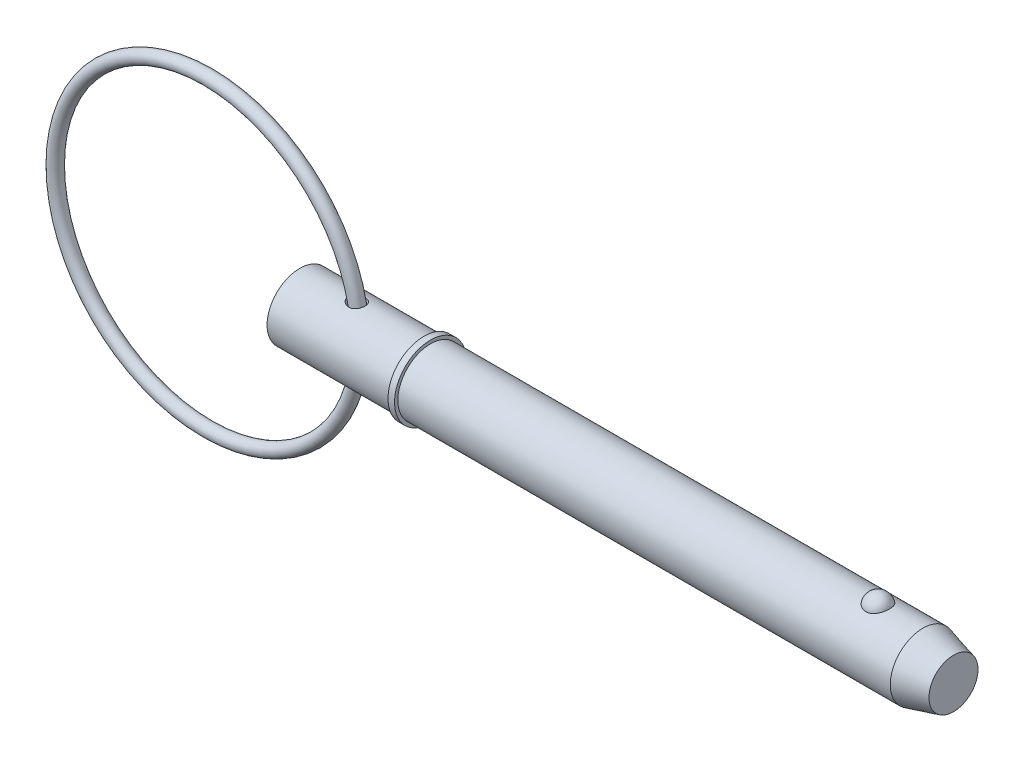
ISO-10303-21;
HEADER;
FILE_DESCRIPTION(('STEP AP214'),'2;1');
FILE_NAME('part.step','',(''),(''),'','','');
FILE_SCHEMA(('AUTOMOTIVE_DESIGN { 1 0 10303 214 1 1 1 1 }'));
ENDSEC;
DATA;
#1=APPLICATION_CONTEXT('core data for automotive mechanical design processes');
#2=APPLICATION_PROTOCOL_DEFINITION('international standard','automotive_design',2000,#1);
#3=PRODUCT_CONTEXT('',#1,'mechanical');
#4=PRODUCT('Part','Part','',(#3));
#5=PRODUCT_RELATED_PRODUCT_CATEGORY('part','',(#4));
#6=PRODUCT_DEFINITION_FORMATION('','',#4);
#7=PRODUCT_DEFINITION_CONTEXT('part definition',#1,'design');
#8=PRODUCT_DEFINITION('design','',#6,#7);
#9=PRODUCT_DEFINITION_SHAPE('','',#8);
#10=(LENGTH_UNIT() NAMED_UNIT(*) SI_UNIT(.MILLI.,.METRE.));
#11=(NAMED_UNIT(*) PLANE_ANGLE_UNIT() SI_UNIT($,.RADIAN.));
#12=(NAMED_UNIT(*) SI_UNIT($,.STERADIAN.) SOLID_ANGLE_UNIT());
#13=UNCERTAINTY_MEASURE_WITH_UNIT(LENGTH_MEASURE(1.E-05),#10,'distance_accuracy_value','');
#14=(GEOMETRIC_REPRESENTATION_CONTEXT(3) GLOBAL_UNCERTAINTY_ASSIGNED_CONTEXT((#13)) GLOBAL_UNIT_ASSIGNED_CONTEXT((#10,
#11,#12)) REPRESENTATION_CONTEXT('',''));
#15=CARTESIAN_POINT('',(0.,0.,0.));
#16=DIRECTION('',(0.,0.,1.));
#17=DIRECTION('',(1.,0.,0.));
#18=AXIS2_PLACEMENT_3D('',#15,#16,#17);
#19=CARTESIAN_POINT('',(-13.4013067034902,0.,0.));
#20=DIRECTION('',(0.,0.,1.));
#21=DIRECTION('',(1.,0.,0.));
#22=AXIS2_PLACEMENT_3D('',#19,#20,#21);
#23=TOROIDAL_SURFACE('',#22,22.225,0.952999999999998);
#24=CARTESIAN_POINT('',(9.77669329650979,0.,0.));
#25=VERTEX_POINT('',#24);
#26=VERTEX_LOOP('',#25);
#27=FACE_BOUND('',#26,.T.);
#28=ADVANCED_FACE('P0_F12',(#27),#23,.T.);
#29=CLOSED_SHELL('',(#28));
#30=MANIFOLD_SOLID_BREP('P0_B1',#29);
#31=CARTESIAN_POINT('',(0.,0.,0.));
#32=DIRECTION('',(1.,0.,0.));
#33=DIRECTION('',(0.,0.,-1.));
#34=AXIS2_PLACEMENT_3D('',#31,#32,#33);
#35=CYLINDRICAL_SURFACE('',#34,4.765);
#36=CARTESIAN_POINT('',(7.31773584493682,4.71580709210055,-0.682926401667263));
#37=CARTESIAN_POINT('',(7.3607471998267,4.70750812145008,-0.740230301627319));
#38=CARTESIAN_POINT('',(7.40883112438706,4.69869300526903,-0.79371122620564));
#39=CARTESIAN_POINT('',(7.51340999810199,4.68106981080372,-0.89180043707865));
#40=CARTESIAN_POINT('',(7.56991882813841,4.67226176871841,-0.936393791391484));
#41=CARTESIAN_POINT('',(7.689548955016,4.65568581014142,-1.01560363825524));
#42=CARTESIAN_POINT('',(7.75265928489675,4.64791621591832,-1.05023633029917));
#43=CARTESIAN_POINT('',(7.88387110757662,4.6343185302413,-1.10870278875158));
#44=CARTESIAN_POINT('',(7.95197058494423,4.62848966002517,-1.13254088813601));
#45=CARTESIAN_POINT('',(8.09209413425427,4.6194749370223,-1.16877415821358));
#46=CARTESIAN_POINT('',(8.16415141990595,4.6163169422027,-1.18104886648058));
#47=CARTESIAN_POINT('',(8.30937958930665,4.61324608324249,-1.19299123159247));
#48=CARTESIAN_POINT('',(8.38255011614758,4.61333220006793,-1.19266284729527));
#49=CARTESIAN_POINT('',(8.52374186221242,4.61674026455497,-1.17939593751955));
#50=CARTESIAN_POINT('',(8.59183022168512,4.61989017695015,-1.16712781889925));
#51=CARTESIAN_POINT('',(8.72470143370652,4.62884731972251,-1.13107903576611));
#52=CARTESIAN_POINT('',(8.78948513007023,4.63465386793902,-1.10730132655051));
#53=CARTESIAN_POINT('',(8.91088768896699,4.64792402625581,-1.05016249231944));
#54=CARTESIAN_POINT('',(8.96774302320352,4.65530108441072,-1.01728198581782));
#55=CARTESIAN_POINT('',(9.07499804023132,4.67102002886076,-0.942471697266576));
#56=CARTESIAN_POINT('',(9.12539777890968,4.6793619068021,-0.900541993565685));
#57=CARTESIAN_POINT('',(9.21836221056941,4.69607497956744,-0.808868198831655));
#58=CARTESIAN_POINT('',(9.26093651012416,4.70444612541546,-0.759133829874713));
#59=CARTESIAN_POINT('',(9.33728390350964,4.72032100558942,-0.653192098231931));
#60=CARTESIAN_POINT('',(9.3710564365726,4.72782468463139,-0.596984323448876));
#61=CARTESIAN_POINT('',(9.42940600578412,4.74126034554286,-0.478808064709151));
#62=CARTESIAN_POINT('',(9.45384681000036,4.74716869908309,-0.416769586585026));
#63=CARTESIAN_POINT('',(9.49226260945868,4.75663465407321,-0.289362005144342));
#64=CARTESIAN_POINT('',(9.50623742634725,4.76019221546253,-0.22399284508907));
#65=CARTESIAN_POINT('',(9.52342004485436,4.76458450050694,-0.0914886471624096));
#66=CARTESIAN_POINT('',(9.52658321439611,4.7654079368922,-0.0243474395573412));
#67=CARTESIAN_POINT('',(9.52194012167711,4.76421136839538,0.109528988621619));
#68=CARTESIAN_POINT('',(9.51413380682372,4.7621913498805,0.176264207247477));
#69=CARTESIAN_POINT('',(9.48775485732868,4.75552896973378,0.307367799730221));
#70=CARTESIAN_POINT('',(9.4691926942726,4.75088915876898,0.371738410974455));
#71=CARTESIAN_POINT('',(9.42175836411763,4.73949008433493,0.496364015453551));
#72=CARTESIAN_POINT('',(9.39288586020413,4.73273075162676,0.556618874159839));
#73=CARTESIAN_POINT('',(9.32549385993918,4.71782154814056,0.671371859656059));
#74=CARTESIAN_POINT('',(9.28696367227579,4.70967013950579,0.725863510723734));
#75=CARTESIAN_POINT('',(9.20123305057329,4.6928883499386,0.827453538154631));
#76=CARTESIAN_POINT('',(9.15403300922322,4.68425799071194,0.874552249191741));
#77=CARTESIAN_POINT('',(9.05250467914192,4.66754854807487,0.959736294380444));
#78=CARTESIAN_POINT('',(8.99822095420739,4.65946646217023,0.997874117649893));
#79=CARTESIAN_POINT('',(8.88381123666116,4.64472049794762,1.06440739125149));
#80=CARTESIAN_POINT('',(8.82368614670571,4.63805640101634,1.09280434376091));
#81=CARTESIAN_POINT('',(8.70022952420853,4.62698068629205,1.13878427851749));
#82=CARTESIAN_POINT('',(8.63695594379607,4.62253830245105,1.15651569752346));
#83=CARTESIAN_POINT('',(8.50825296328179,4.61622454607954,1.18146656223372));
#84=CARTESIAN_POINT('',(8.44282353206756,4.61435321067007,1.18868585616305));
#85=CARTESIAN_POINT('',(8.31119087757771,4.61332122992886,1.19268442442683));
#86=CARTESIAN_POINT('',(8.24498542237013,4.61417920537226,1.18939198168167));
#87=CARTESIAN_POINT('',(8.11397487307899,4.61847671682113,1.17259121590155));
#88=CARTESIAN_POINT('',(8.04917011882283,4.62191687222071,1.15908044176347));
#89=CARTESIAN_POINT('',(7.91946226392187,4.63117528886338,1.12153047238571));
#90=CARTESIAN_POINT('',(7.85470460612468,4.6371000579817,1.09701575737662));
#91=CARTESIAN_POINT('',(7.7300035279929,4.65063246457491,1.03814807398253));
#92=CARTESIAN_POINT('',(7.67006197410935,4.65824075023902,1.00379131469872));
#93=CARTESIAN_POINT('',(7.55352765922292,4.67473656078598,0.924015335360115));
#94=CARTESIAN_POINT('',(7.49726947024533,4.68366994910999,0.878115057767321));
#95=CARTESIAN_POINT('',(7.39344083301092,4.70144936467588,0.777311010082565));
#96=CARTESIAN_POINT('',(7.34587087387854,4.71029538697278,0.722406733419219));
#97=CARTESIAN_POINT('',(7.26188955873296,4.72669773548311,0.605773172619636));
#98=CARTESIAN_POINT('',(7.22531316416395,4.73427229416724,0.544165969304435));
#99=CARTESIAN_POINT('',(7.16406269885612,4.74732663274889,0.415095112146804));
#100=CARTESIAN_POINT('',(7.13937848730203,4.75280819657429,0.347636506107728));
#101=CARTESIAN_POINT('',(7.10494917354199,4.7605495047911,0.215359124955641));
#102=CARTESIAN_POINT('',(7.09405441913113,4.76305589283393,0.150853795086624));
#103=CARTESIAN_POINT('',(7.08387189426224,4.76539656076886,0.0208839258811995));
#104=CARTESIAN_POINT('',(7.0845805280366,4.76523166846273,-0.0445803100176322));
#105=CARTESIAN_POINT('',(7.09709111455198,4.76236014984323,-0.169693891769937));
#106=CARTESIAN_POINT('',(7.10810913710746,4.75983315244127,-0.229428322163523));
#107=CARTESIAN_POINT('',(7.13959099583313,4.75276726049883,-0.346187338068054));
#108=CARTESIAN_POINT('',(7.16004881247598,4.7482296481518,-0.403213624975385));
#109=CARTESIAN_POINT('',(7.20270325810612,4.73907067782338,-0.498040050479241));
#110=CARTESIAN_POINT('',(7.22286864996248,4.73481668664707,-0.536809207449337));
#111=CARTESIAN_POINT('',(7.26730952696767,4.72570777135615,-0.611832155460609));
#112=CARTESIAN_POINT('',(7.29158512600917,4.72085283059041,-0.64808587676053));
#113=CARTESIAN_POINT('',(7.31773584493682,4.71580709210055,-0.682926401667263));
#114=B_SPLINE_CURVE_WITH_KNOTS('',3,(#36,#37,#38,#39,#40,#41,#42,#43,#44,#45,#46,#47,#48,#49,
#50,#51,#52,#53,#54,#55,#56,#57,#58,#59,#60,#61,#62,#63,#64,#65,#66,#67,#68,#69,#70,#71,#72,#73,
#74,#75,#76,#77,#78,#79,#80,#81,#82,#83,#84,#85,#86,#87,#88,#89,#90,#91,#92,#93,#94,#95,#96,#97,
#98,#99,#100,#101,#102,#103,#104,#105,#106,#107,#108,#109,#110,#111,#112,#113),.UNSPECIFIED.,
.T.,.F.,(4,2,2,2,2,2,2,2,2,2,2,2,2,2,2,2,2,2,2,2,2,2,2,2,2,2,2,2,2,2,2,2,2,2,2,2,2,2,4),(0.,
0.216219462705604,0.432799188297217,0.649024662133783,0.865163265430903,1.08352938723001,
1.30182691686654,1.50853487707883,1.71518978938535,1.91252381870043,2.1098561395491,
2.30694457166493,2.50404555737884,2.70392296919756,2.90380378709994,3.10450875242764,
3.30521468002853,3.5057255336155,3.70624293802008,3.90698330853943,4.10771458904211,
4.30723900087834,4.50673262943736,4.70338139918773,4.90003300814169,5.09802914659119,
5.29607279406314,5.5036500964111,5.7113074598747,5.92972727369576,6.14815938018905,
6.36312650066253,6.57790998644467,6.77325899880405,6.96854747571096,7.15009726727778,
7.33153144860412,7.46298830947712,7.59444881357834),.UNSPECIFIED.);
#115=CARTESIAN_POINT('',(7.31773584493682,4.71580709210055,-0.682926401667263));
#116=VERTEX_POINT('',#115);
#117=EDGE_CURVE('P1_E42',#116,#116,#114,.T.);
#118=ORIENTED_EDGE('',*,*,#117,.T.);
#119=EDGE_LOOP('',(#118));
#120=FACE_BOUND('',#119,.T.);
#121=CARTESIAN_POINT('',(0.,0.,0.));
#122=DIRECTION('',(1.,0.,0.));
#123=DIRECTION('',(0.,0.,-1.));
#124=AXIS2_PLACEMENT_3D('',#121,#122,#123);
#125=CIRCLE('',#124,4.765);
#126=CARTESIAN_POINT('',(0.,0.,-4.765));
#127=VERTEX_POINT('',#126);
#128=EDGE_CURVE('P1_E9',#127,#127,#125,.T.);
#129=ORIENTED_EDGE('',*,*,#128,.T.);
#130=EDGE_LOOP('',(#129));
#131=FACE_BOUND('',#130,.T.);
#132=CARTESIAN_POINT('',(18.097,0.,0.));
#133=DIRECTION('',(1.,0.,0.));
#134=DIRECTION('',(0.,0.,-1.));
#135=AXIS2_PLACEMENT_3D('',#132,#133,#134);
#136=CIRCLE('',#135,4.765);
#137=CARTESIAN_POINT('',(18.097,0.,-4.765));
#138=VERTEX_POINT('',#137);
#139=EDGE_CURVE('P1_E25',#138,#138,#136,.T.);
#140=ORIENTED_EDGE('',*,*,#139,.F.);
#141=EDGE_LOOP('',(#140));
#142=FACE_BOUND('',#141,.T.);
#143=CARTESIAN_POINT('',(7.31773584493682,-4.71580709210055,-0.682926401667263));
#144=CARTESIAN_POINT('',(7.27956054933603,-4.72317282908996,-0.63206220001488));
#145=CARTESIAN_POINT('',(7.24535712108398,-4.7301361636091,-0.578155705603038));
#146=CARTESIAN_POINT('',(7.18611785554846,-4.74256090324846,-0.465352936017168));
#147=CARTESIAN_POINT('',(7.16107836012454,-4.74802290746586,-0.406458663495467));
#148=CARTESIAN_POINT('',(7.12119149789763,-4.75686558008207,-0.284913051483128));
#149=CARTESIAN_POINT('',(7.1063796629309,-4.76023898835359,-0.222249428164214));
#150=CARTESIAN_POINT('',(7.08786546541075,-4.76447177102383,-0.0952170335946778));
#151=CARTESIAN_POINT('',(7.08416018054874,-4.76533180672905,-0.0308487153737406));
#152=CARTESIAN_POINT('',(7.08795686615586,-4.76445764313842,0.0942755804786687));
#153=CARTESIAN_POINT('',(7.09490366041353,-4.762851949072,0.155050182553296));
#154=CARTESIAN_POINT('',(7.11863973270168,-4.75746086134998,0.2745356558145));
#155=CARTESIAN_POINT('',(7.13542953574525,-4.75367535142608,0.333246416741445));
#156=CARTESIAN_POINT('',(7.17817193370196,-4.74430545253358,0.447305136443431));
#157=CARTESIAN_POINT('',(7.20415836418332,-4.73871442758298,0.502639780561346));
#158=CARTESIAN_POINT('',(7.26428068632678,-4.72628508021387,0.608523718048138));
#159=CARTESIAN_POINT('',(7.29841897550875,-4.71944639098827,0.659071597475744));
#160=CARTESIAN_POINT('',(7.37680984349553,-4.70456239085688,0.758311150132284));
#161=CARTESIAN_POINT('',(7.42165519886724,-4.69646426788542,0.806526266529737));
#162=CARTESIAN_POINT('',(7.51828933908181,-4.68032890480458,0.895428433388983));
#163=CARTESIAN_POINT('',(7.57008134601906,-4.67229169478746,0.936111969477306));
#164=CARTESIAN_POINT('',(7.68397204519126,-4.65640659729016,1.01229731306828));
#165=CARTESIAN_POINT('',(7.74657226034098,-4.64863251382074,1.04706751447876));
#166=CARTESIAN_POINT('',(7.87680110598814,-4.6349740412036,1.10596507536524));
#167=CARTESIAN_POINT('',(7.94443054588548,-4.62908995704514,1.13009071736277));
#168=CARTESIAN_POINT('',(8.08402017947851,-4.61989019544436,1.16713943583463));
#169=CARTESIAN_POINT('',(8.15603143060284,-4.61661596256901,1.17988211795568));
#170=CARTESIAN_POINT('',(8.30124697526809,-4.61330446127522,1.1927680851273));
#171=CARTESIAN_POINT('',(8.37445077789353,-4.61326589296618,1.19291642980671));
#172=CARTESIAN_POINT('',(8.51584800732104,-4.61644036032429,1.18056687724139));
#173=CARTESIAN_POINT('',(8.58410302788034,-4.61948317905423,1.16873099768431));
#174=CARTESIAN_POINT('',(8.71738052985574,-4.6282520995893,1.13350536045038));
#175=CARTESIAN_POINT('',(8.78240382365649,-4.63397752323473,1.11011852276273));
#176=CARTESIAN_POINT('',(8.90428519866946,-4.64711877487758,1.05371003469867));
#177=CARTESIAN_POINT('',(8.96138096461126,-4.6544450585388,1.02117932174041));
#178=CARTESIAN_POINT('',(9.06916653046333,-4.6700970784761,0.947021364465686));
#179=CARTESIAN_POINT('',(9.11985639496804,-4.67842280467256,0.905394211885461));
#180=CARTESIAN_POINT('',(9.2134071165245,-4.69513303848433,0.814300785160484));
#181=CARTESIAN_POINT('',(9.25628268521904,-4.70351740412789,0.764849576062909));
#182=CARTESIAN_POINT('',(9.33327173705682,-4.71945185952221,0.659422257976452));
#183=CARTESIAN_POINT('',(9.3673846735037,-4.72700189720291,0.603445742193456));
#184=CARTESIAN_POINT('',(9.42645214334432,-4.74055953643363,0.485673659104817));
#185=CARTESIAN_POINT('',(9.45127042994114,-4.74654383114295,0.423807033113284));
#186=CARTESIAN_POINT('',(9.49046298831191,-4.756182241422,0.296676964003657));
#187=CARTESIAN_POINT('',(9.50483706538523,-4.75983631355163,0.231413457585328));
#188=CARTESIAN_POINT('',(9.52283408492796,-4.76443282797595,0.0990368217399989));
#189=CARTESIAN_POINT('',(9.52641016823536,-4.76536345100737,0.0319169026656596));
#190=CARTESIAN_POINT('',(9.52259067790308,-4.76437893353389,-0.101988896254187));
#191=CARTESIAN_POINT('',(9.5151950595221,-4.76246378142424,-0.168774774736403));
#192=CARTESIAN_POINT('',(9.48962516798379,-4.75599746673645,-0.300048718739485));
#193=CARTESIAN_POINT('',(9.4714615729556,-4.75144891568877,-0.364538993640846));
#194=CARTESIAN_POINT('',(9.42480303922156,-4.74020887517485,-0.489470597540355));
#195=CARTESIAN_POINT('',(9.396307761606,-4.73351731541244,-0.549911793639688));
#196=CARTESIAN_POINT('',(9.32963953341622,-4.71871240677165,-0.665099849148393));
#197=CARTESIAN_POINT('',(9.29145577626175,-4.71059747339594,-0.719840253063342));
#198=CARTESIAN_POINT('',(9.20637695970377,-4.69385254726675,-0.82198328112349));
#199=CARTESIAN_POINT('',(9.15948227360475,-4.68522257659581,-0.869386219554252));
#200=CARTESIAN_POINT('',(9.05849937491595,-4.66847516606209,-0.955233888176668));
#201=CARTESIAN_POINT('',(9.00445430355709,-4.6603550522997,-0.993728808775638));
#202=CARTESIAN_POINT('',(8.8904576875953,-4.64550122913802,-1.06100691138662));
#203=CARTESIAN_POINT('',(8.83050704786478,-4.63876730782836,-1.08979157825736));
#204=CARTESIAN_POINT('',(8.70732873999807,-4.6275305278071,-1.13655620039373));
#205=CARTESIAN_POINT('',(8.64416019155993,-4.62299714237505,-1.15468477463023));
#206=CARTESIAN_POINT('',(8.51559711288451,-4.61649071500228,-1.18043067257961));
#207=CARTESIAN_POINT('',(8.4502025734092,-4.61451768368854,-1.18804795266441));
#208=CARTESIAN_POINT('',(8.31862013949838,-4.61328355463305,-1.19283094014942));
#209=CARTESIAN_POINT('',(8.25242983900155,-4.61403911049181,-1.18993246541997));
#210=CARTESIAN_POINT('',(8.12138461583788,-4.61814057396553,-1.17391149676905));
#211=CARTESIAN_POINT('',(8.0565300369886,-4.62148714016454,-1.16078640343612));
#212=CARTESIAN_POINT('',(7.92669960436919,-4.63056912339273,-1.12402333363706));
#213=CARTESIAN_POINT('',(7.86186447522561,-4.63641051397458,-1.09991536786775));
#214=CARTESIAN_POINT('',(7.73694230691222,-4.64980121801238,-1.04185298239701));
#215=CARTESIAN_POINT('',(7.6768568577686,-4.65735110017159,-1.0078952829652));
#216=CARTESIAN_POINT('',(7.56207884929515,-4.67346080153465,-0.930364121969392));
#217=CARTESIAN_POINT('',(7.5074784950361,-4.68203382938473,-0.886656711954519));
#218=CARTESIAN_POINT('',(7.40624045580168,-4.69916824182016,-0.79082583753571));
#219=CARTESIAN_POINT('',(7.35959988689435,-4.7077296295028,-0.738705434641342));
#220=CARTESIAN_POINT('',(7.31773584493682,-4.71580709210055,-0.682926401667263));
#221=B_SPLINE_CURVE_WITH_KNOTS('',3,(#143,#144,#145,#146,#147,#148,#149,#150,#151,#152,#153,
#154,#155,#156,#157,#158,#159,#160,#161,#162,#163,#164,#165,#166,#167,#168,#169,#170,#171,#172,
#173,#174,#175,#176,#177,#178,#179,#180,#181,#182,#183,#184,#185,#186,#187,#188,#189,#190,#191,
#192,#193,#194,#195,#196,#197,#198,#199,#200,#201,#202,#203,#204,#205,#206,#207,#208,#209,#210,
#211,#212,#213,#214,#215,#216,#217,#218,#219,#220),.UNSPECIFIED.,.T.,.F.,(4,2,2,2,2,2,2,2,2,2,2,
2,2,2,2,2,2,2,2,2,2,2,2,2,2,2,2,2,2,2,2,2,2,2,2,2,2,2,4),(0.,0.191851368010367,0.38362606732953,
0.576063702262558,0.768450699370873,0.951145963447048,1.13385097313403,1.31723528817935,
1.50067360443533,1.69887079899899,1.8971602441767,2.11225870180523,2.32739185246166,
2.54587681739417,2.76427400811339,2.97123130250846,3.17813630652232,3.37555441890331,
3.57297054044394,3.77001106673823,3.96706388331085,4.16690159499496,4.36674303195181,
4.56745046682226,4.76815872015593,4.96866827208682,5.16918440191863,5.36992517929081,
5.5706573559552,5.77022940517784,5.96977092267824,6.16645904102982,6.36314797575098,
6.56103940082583,6.75898114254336,6.96633026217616,7.17374850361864,7.384214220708,
7.59460352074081),.UNSPECIFIED.);
#222=CARTESIAN_POINT('',(7.31773584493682,-4.71580709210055,-0.682926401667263));
#223=VERTEX_POINT('',#222);
#224=EDGE_CURVE('P1_E17',#223,#223,#221,.T.);
#225=ORIENTED_EDGE('',*,*,#224,.T.);
#226=EDGE_LOOP('',(#225));
#227=FACE_BOUND('',#226,.T.);
#228=ADVANCED_FACE('P1_F13',(#120,#131,#142,#227),#35,.T.);
#229=CARTESIAN_POINT('',(0.,0.,0.));
#230=DIRECTION('',(1.,0.,0.));
#231=DIRECTION('',(0.,0.,-1.));
#232=AXIS2_PLACEMENT_3D('',#229,#230,#231);
#233=CYLINDRICAL_SURFACE('',#232,4.765);
#234=CARTESIAN_POINT('',(90.8041944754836,0.,0.));
#235=DIRECTION('',(1.,0.,0.));
#236=DIRECTION('',(0.,0.,-1.));
#237=AXIS2_PLACEMENT_3D('',#234,#235,#236);
#238=CIRCLE('',#237,4.765);
#239=CARTESIAN_POINT('',(90.8041944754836,0.,-4.765));
#240=VERTEX_POINT('',#239);
#241=EDGE_CURVE('P1_E99',#240,#240,#238,.T.);
#242=ORIENTED_EDGE('',*,*,#241,.F.);
#243=EDGE_LOOP('',(#242));
#244=FACE_BOUND('',#243,.T.);
#245=CARTESIAN_POINT('',(19.05,0.,0.));
#246=DIRECTION('',(1.,0.,0.));
#247=DIRECTION('',(0.,0.,-1.));
#248=AXIS2_PLACEMENT_3D('',#245,#246,#247);
#249=CIRCLE('',#248,4.765);
#250=CARTESIAN_POINT('',(19.05,0.,-4.765));
#251=VERTEX_POINT('',#250);
#252=EDGE_CURVE('P1_E96',#251,#251,#249,.T.);
#253=ORIENTED_EDGE('',*,*,#252,.T.);
#254=EDGE_LOOP('',(#253));
#255=FACE_BOUND('',#254,.T.);
#256=CARTESIAN_POINT('',(84.251020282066,4.42764777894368,1.76101111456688));
#257=CARTESIAN_POINT('',(84.1597212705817,4.42764470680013,1.76101422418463));
#258=CARTESIAN_POINT('',(84.0684468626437,4.43059091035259,1.75366340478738));
#259=CARTESIAN_POINT('',(83.8886154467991,4.44201846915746,1.72451180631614));
#260=CARTESIAN_POINT('',(83.8000577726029,4.45049845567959,1.70271460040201));
#261=CARTESIAN_POINT('',(83.6282570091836,4.47200516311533,1.6453937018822));
#262=CARTESIAN_POINT('',(83.5450064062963,4.48502527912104,1.60988994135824));
#263=CARTESIAN_POINT('',(83.3857633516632,4.51419542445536,1.52617873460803));
#264=CARTESIAN_POINT('',(83.3097723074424,4.53034605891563,1.47796883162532));
#265=CARTESIAN_POINT('',(83.1647445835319,4.5645931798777,1.36860494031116));
#266=CARTESIAN_POINT('',(83.0959645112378,4.58273170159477,1.30712420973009));
#267=CARTESIAN_POINT('',(82.9693423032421,4.61870302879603,1.17370204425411));
#268=CARTESIAN_POINT('',(82.9115021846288,4.63653577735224,1.10175868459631));
#269=CARTESIAN_POINT('',(82.8055709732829,4.67090140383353,0.945806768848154));
#270=CARTESIAN_POINT('',(82.7580305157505,4.68734068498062,0.861402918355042));
#271=CARTESIAN_POINT('',(82.6770817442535,4.71628466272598,0.685442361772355));
#272=CARTESIAN_POINT('',(82.6436747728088,4.72878898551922,0.593884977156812));
#273=CARTESIAN_POINT('',(82.591287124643,4.74874061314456,0.404781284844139));
#274=CARTESIAN_POINT('',(82.5725178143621,4.75611366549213,0.30716844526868));
#275=CARTESIAN_POINT('',(82.5505846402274,4.76475393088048,0.109940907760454));
#276=CARTESIAN_POINT('',(82.5474205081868,4.76602124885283,0.0103262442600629));
#277=CARTESIAN_POINT('',(82.5567405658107,4.76232928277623,-0.187629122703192));
#278=CARTESIAN_POINT('',(82.5691588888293,4.7573962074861,-0.285973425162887));
#279=CARTESIAN_POINT('',(82.6092804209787,4.74184975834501,-0.47902728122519));
#280=CARTESIAN_POINT('',(82.6369839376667,4.7312362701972,-0.573736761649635));
#281=CARTESIAN_POINT('',(82.7071581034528,4.70540026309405,-0.756973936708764));
#282=CARTESIAN_POINT('',(82.7496460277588,4.69017235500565,-0.845494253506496));
#283=CARTESIAN_POINT('',(82.848520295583,4.6566986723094,-1.01378033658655));
#284=CARTESIAN_POINT('',(82.9049076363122,4.63845268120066,-1.09354547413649));
#285=CARTESIAN_POINT('',(83.030552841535,4.60085438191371,-1.24228523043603));
#286=CARTESIAN_POINT('',(83.0998439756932,4.58149930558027,-1.31123108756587));
#287=CARTESIAN_POINT('',(83.2496066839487,4.54391653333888,-1.43607409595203));
#288=CARTESIAN_POINT('',(83.3300771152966,4.52568872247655,-1.49197257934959));
#289=CARTESIAN_POINT('',(83.4981500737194,4.49293007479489,-1.58786764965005));
#290=CARTESIAN_POINT('',(83.5855445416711,4.47832346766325,-1.62820219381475));
#291=CARTESIAN_POINT('',(83.766553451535,4.45406011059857,-1.69345757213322));
#292=CARTESIAN_POINT('',(83.8601655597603,4.44440151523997,-1.71838415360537));
#293=CARTESIAN_POINT('',(84.0458939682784,4.43159888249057,-1.75112843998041));
#294=CARTESIAN_POINT('',(84.137849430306,4.42815213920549,-1.75974223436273));
#295=CARTESIAN_POINT('',(84.3219658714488,4.427247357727,-1.76201865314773));
#296=CARTESIAN_POINT('',(84.4141268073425,4.42978816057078,-1.7556841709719));
#297=CARTESIAN_POINT('',(84.5931292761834,4.4403864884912,-1.72869560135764));
#298=CARTESIAN_POINT('',(84.6800474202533,4.44827555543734,-1.70847853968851));
#299=CARTESIAN_POINT('',(84.8491314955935,4.46852246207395,-1.65479562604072));
#300=CARTESIAN_POINT('',(84.9312970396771,4.48088066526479,-1.62132869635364));
#301=CARTESIAN_POINT('',(85.0905916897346,4.50907357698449,-1.54120560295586));
#302=CARTESIAN_POINT('',(85.1675700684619,4.52497884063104,-1.49427526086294));
#303=CARTESIAN_POINT('',(85.3127080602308,4.55845148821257,-1.38881222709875));
#304=CARTESIAN_POINT('',(85.3808656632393,4.57601924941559,-1.33027689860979));
#305=CARTESIAN_POINT('',(85.5100990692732,4.61196537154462,-1.19991049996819));
#306=CARTESIAN_POINT('',(85.5706562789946,4.63034074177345,-1.12756415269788));
#307=CARTESIAN_POINT('',(85.6792797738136,4.66513959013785,-0.973612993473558));
#308=CARTESIAN_POINT('',(85.7273438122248,4.68156271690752,-0.892006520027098));
#309=CARTESIAN_POINT('',(85.811383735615,4.71130224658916,-0.718892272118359));
#310=CARTESIAN_POINT('',(85.8469185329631,4.724501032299,-0.627149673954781));
#311=CARTESIAN_POINT('',(85.9029522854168,4.74571823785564,-0.438611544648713));
#312=CARTESIAN_POINT('',(85.923450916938,4.75373654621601,-0.341815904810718));
#313=CARTESIAN_POINT('',(85.9490338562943,4.76378905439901,-0.145633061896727));
#314=CARTESIAN_POINT('',(85.954076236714,4.76580697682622,-0.046239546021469));
#315=CARTESIAN_POINT('',(85.9485239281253,4.7636057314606,0.152038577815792));
#316=CARTESIAN_POINT('',(85.9379294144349,4.75938663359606,0.250923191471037));
#317=CARTESIAN_POINT('',(85.9013875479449,4.74516937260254,0.445004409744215));
#318=CARTESIAN_POINT('',(85.8754964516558,4.73519238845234,0.54021317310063));
#319=CARTESIAN_POINT('',(85.8089273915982,4.71049394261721,0.724662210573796));
#320=CARTESIAN_POINT('',(85.768248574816,4.69577220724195,0.81390214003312));
#321=CARTESIAN_POINT('',(85.6727177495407,4.66303767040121,0.984313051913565));
#322=CARTESIAN_POINT('',(85.6178042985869,4.64501070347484,1.06544688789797));
#323=CARTESIAN_POINT('',(85.4950496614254,4.60764678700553,1.21692673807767));
#324=CARTESIAN_POINT('',(85.4272086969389,4.58830985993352,1.2872729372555));
#325=CARTESIAN_POINT('',(85.2805480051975,4.55060370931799,1.41479271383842));
#326=CARTESIAN_POINT('',(85.2017918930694,4.53222967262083,1.47203785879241));
#327=CARTESIAN_POINT('',(85.0349890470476,4.49849576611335,1.57212016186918));
#328=CARTESIAN_POINT('',(84.9469417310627,4.48313608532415,1.61495641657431));
#329=CARTESIAN_POINT('',(84.7597918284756,4.45676184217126,1.68642657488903));
#330=CARTESIAN_POINT('',(84.6603653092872,4.44598302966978,1.71430590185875));
#331=CARTESIAN_POINT('',(84.4576210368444,4.43142918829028,1.75159258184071));
#332=CARTESIAN_POINT('',(84.3543049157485,4.42765125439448,1.76100759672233));
#333=CARTESIAN_POINT('',(84.251020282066,4.42764777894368,1.76101111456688));
#334=B_SPLINE_CURVE_WITH_KNOTS('',3,(#256,#257,#258,#259,#260,#261,#262,#263,#264,#265,#266,
#267,#268,#269,#270,#271,#272,#273,#274,#275,#276,#277,#278,#279,#280,#281,#282,#283,#284,#285,
#286,#287,#288,#289,#290,#291,#292,#293,#294,#295,#296,#297,#298,#299,#300,#301,#302,#303,#304,
#305,#306,#307,#308,#309,#310,#311,#312,#313,#314,#315,#316,#317,#318,#319,#320,#321,#322,#323,
#324,#325,#326,#327,#328,#329,#330,#331,#332,#333),.UNSPECIFIED.,.T.,.F.,(4,2,2,2,2,2,2,2,2,2,2,
2,2,2,2,2,2,2,2,2,2,2,2,2,2,2,2,2,2,2,2,2,2,2,2,2,2,2,4),(0.,0.273517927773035,
0.546968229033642,0.820022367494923,1.09312934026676,1.37393946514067,1.65480131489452,
1.94820420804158,2.24163496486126,2.53922817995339,2.8368162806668,3.13315071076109,
3.42949110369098,3.72617893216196,4.02288805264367,4.32037303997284,4.61782764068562,
4.90840095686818,5.19886582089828,5.4747485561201,5.75057789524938,6.01809977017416,
6.2856434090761,6.55907787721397,6.83257454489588,7.11962987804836,7.40673679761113,
7.70312663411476,7.99952284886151,8.29672237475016,8.59391856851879,8.89002850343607,
9.18615552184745,9.483582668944,9.78100471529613,10.0767610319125,10.3725358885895,
10.6820893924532,10.991514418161),.UNSPECIFIED.);
#335=CARTESIAN_POINT('',(84.251020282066,4.42764777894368,1.76101111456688));
#336=VERTEX_POINT('',#335);
#337=EDGE_CURVE('P1_E34',#336,#336,#334,.T.);
#338=ORIENTED_EDGE('',*,*,#337,.T.);
#339=EDGE_LOOP('',(#338));
#340=FACE_BOUND('',#339,.T.);
#341=ADVANCED_FACE('P1_F46',(#244,#255,#340),#233,.T.);
#342=CARTESIAN_POINT('',(0.,0.,0.));
#343=DIRECTION('',(-1.,0.,0.));
#344=DIRECTION('',(0.,0.,1.));
#345=AXIS2_PLACEMENT_3D('',#342,#343,#344);
#346=PLANE('',#345);
#347=ORIENTED_EDGE('',*,*,#128,.F.);
#348=EDGE_LOOP('',(#347));
#349=FACE_BOUND('',#348,.T.);
#350=ADVANCED_FACE('P1_F15',(#349),#346,.T.);
#351=CARTESIAN_POINT('',(18.097,4.765,0.));
#352=DIRECTION('',(-1.,0.,0.));
#353=DIRECTION('',(0.,0.,1.));
#354=AXIS2_PLACEMENT_3D('',#351,#352,#353);
#355=PLANE('',#354);
#356=ORIENTED_EDGE('',*,*,#139,.T.);
#357=EDGE_LOOP('',(#356));
#358=FACE_BOUND('',#357,.T.);
#359=CARTESIAN_POINT('',(18.097,0.,0.));
#360=DIRECTION('',(1.,0.,0.));
#361=DIRECTION('',(0.,0.,-1.));
#362=AXIS2_PLACEMENT_3D('',#359,#360,#361);
#363=CIRCLE('',#362,5.2415);
#364=CARTESIAN_POINT('',(18.097,0.,-5.2415));
#365=VERTEX_POINT('',#364);
#366=EDGE_CURVE('P1_E30',#365,#365,#363,.T.);
#367=ORIENTED_EDGE('',*,*,#366,.F.);
#368=EDGE_LOOP('',(#367));
#369=FACE_BOUND('',#368,.T.);
#370=ADVANCED_FACE('P1_F81',(#358,#369),#355,.T.);
#371=CARTESIAN_POINT('',(0.,0.,0.));
#372=DIRECTION('',(1.,0.,0.));
#373=DIRECTION('',(0.,0.,-1.));
#374=AXIS2_PLACEMENT_3D('',#371,#372,#373);
#375=CYLINDRICAL_SURFACE('',#374,5.2415);
#376=ORIENTED_EDGE('',*,*,#366,.T.);
#377=EDGE_LOOP('',(#376));
#378=FACE_BOUND('',#377,.T.);
#379=CARTESIAN_POINT('',(19.05,0.,0.));
#380=DIRECTION('',(1.,0.,0.));
#381=DIRECTION('',(0.,0.,-1.));
#382=AXIS2_PLACEMENT_3D('',#379,#380,#381);
#383=CIRCLE('',#382,5.2415);
#384=CARTESIAN_POINT('',(19.05,0.,-5.2415));
#385=VERTEX_POINT('',#384);
#386=EDGE_CURVE('P1_E95',#385,#385,#383,.T.);
#387=ORIENTED_EDGE('',*,*,#386,.F.);
#388=EDGE_LOOP('',(#387));
#389=FACE_BOUND('',#388,.T.);
#390=ADVANCED_FACE('P1_F68',(#378,#389),#375,.T.);
#391=CARTESIAN_POINT('',(19.05,5.2415,0.));
#392=DIRECTION('',(1.,0.,0.));
#393=DIRECTION('',(0.,0.,-1.));
#394=AXIS2_PLACEMENT_3D('',#391,#392,#393);
#395=PLANE('',#394);
#396=ORIENTED_EDGE('',*,*,#386,.T.);
#397=EDGE_LOOP('',(#396));
#398=FACE_BOUND('',#397,.T.);
#399=ORIENTED_EDGE('',*,*,#252,.F.);
#400=EDGE_LOOP('',(#399));
#401=FACE_BOUND('',#400,.T.);
#402=ADVANCED_FACE('P1_F62',(#398,#401),#395,.T.);
#403=CARTESIAN_POINT('',(95.25,0.,0.));
#404=DIRECTION('',(-1.,0.,0.));
#405=DIRECTION('',(0.,0.,1.));
#406=AXIS2_PLACEMENT_3D('',#403,#404,#405);
#407=CONICAL_SURFACE('',#406,3.57375000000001,0.261799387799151);
#408=ORIENTED_EDGE('',*,*,#241,.T.);
#409=EDGE_LOOP('',(#408));
#410=FACE_BOUND('',#409,.T.);
#411=CARTESIAN_POINT('',(95.25,0.,0.));
#412=DIRECTION('',(1.,0.,0.));
#413=DIRECTION('',(0.,0.,-1.));
#414=AXIS2_PLACEMENT_3D('',#411,#412,#413);
#415=CIRCLE('',#414,3.57375000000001);
#416=CARTESIAN_POINT('',(95.25,0.,-3.57375000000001));
#417=VERTEX_POINT('',#416);
#418=EDGE_CURVE('P1_E41',#417,#417,#415,.T.);
#419=ORIENTED_EDGE('',*,*,#418,.F.);
#420=EDGE_LOOP('',(#419));
#421=FACE_BOUND('',#420,.T.);
#422=ADVANCED_FACE('P1_F59',(#410,#421),#407,.T.);
#423=CARTESIAN_POINT('',(95.25,3.57375000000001,0.));
#424=DIRECTION('',(1.,0.,0.));
#425=DIRECTION('',(0.,0.,-1.));
#426=AXIS2_PLACEMENT_3D('',#423,#424,#425);
#427=PLANE('',#426);
#428=ORIENTED_EDGE('',*,*,#418,.T.);
#429=EDGE_LOOP('',(#428));
#430=FACE_BOUND('',#429,.T.);
#431=ADVANCED_FACE('P1_F55',(#430),#427,.T.);
#432=CARTESIAN_POINT('',(84.251020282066,4.2885,0.));
#433=DIRECTION('',(-1.,0.,0.));
#434=DIRECTION('',(0.,1.,0.));
#435=AXIS2_PLACEMENT_3D('',#432,#433,#434);
#436=SPHERICAL_SURFACE('',#435,1.7665);
#437=ORIENTED_EDGE('',*,*,#337,.F.);
#438=EDGE_LOOP('',(#437));
#439=FACE_BOUND('',#438,.T.);
#440=ADVANCED_FACE('P1_F50',(#439),#436,.T.);
#441=CARTESIAN_POINT('',(-13.4013067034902,0.,0.));
#442=DIRECTION('',(0.,0.,1.));
#443=DIRECTION('',(1.,0.,0.));
#444=AXIS2_PLACEMENT_3D('',#441,#442,#443);
#445=TOROIDAL_SURFACE('',#444,22.225,1.19125);
#446=ORIENTED_EDGE('',*,*,#224,.F.);
#447=EDGE_LOOP('',(#446));
#448=FACE_BOUND('',#447,.T.);
#449=ORIENTED_EDGE('',*,*,#117,.F.);
#450=EDGE_LOOP('',(#449));
#451=FACE_BOUND('',#450,.T.);
#452=ADVANCED_FACE('P1_F54',(#448,#451),#445,.F.);
#453=CLOSED_SHELL('',(#228,#341,#350,#370,#390,#402,#422,#431,#440,#452));
#454=MANIFOLD_SOLID_BREP('P1_B1',#453);
#455=ADVANCED_BREP_SHAPE_REPRESENTATION('',(#18,#30,#454),#14);
#456=SHAPE_DEFINITION_REPRESENTATION(#9,#455);
ENDSEC;
END-ISO-10303-21;
